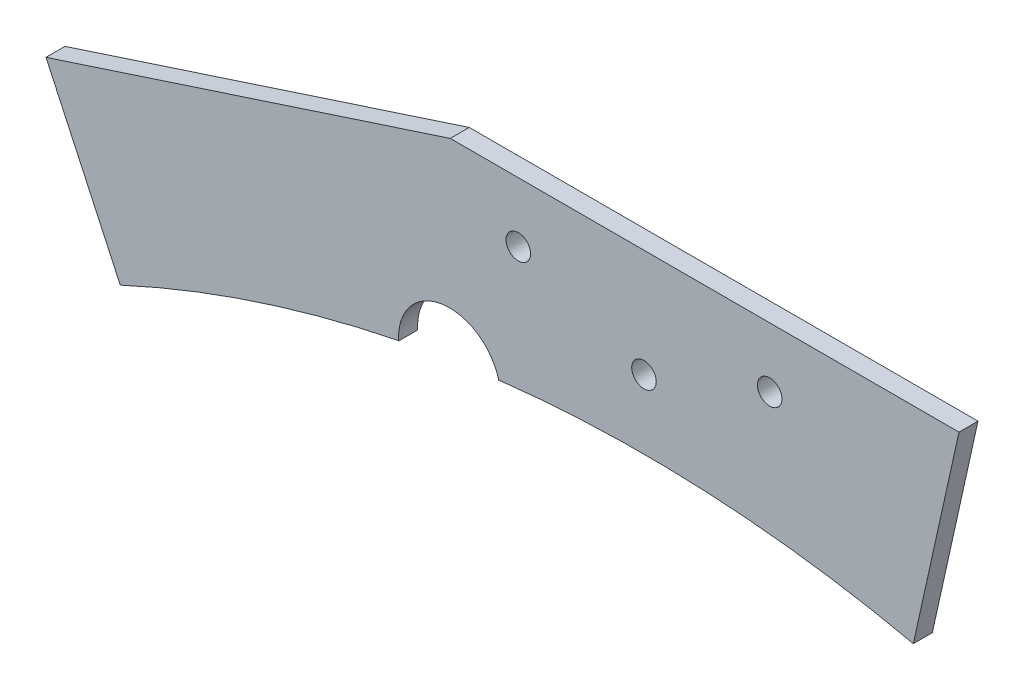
from build123d import *
from build123d.topology import SkipClean

# Parameters (mm, degrees)
BOSS_EXTRUDE1_DEPTH     = 6.35
SKETCH6_R               = 4.1
CUT_EXTRUDE1_DEPTH      = 524.620469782
SKETCH8_R               = 4.1
CUT_EXTRUDE2_DEPTH      = 524.620469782
CUT_EXTRUDE3_DEPTH      = 524.620469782
CUT_EXTRUDE3_DEPTH_BACK = 524.620469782
CUT_EXTRUDE8_DEPTH      = 516.357390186
BOSS_EXTRUDE3_START     = 6.35
BOSS_EXTRUDE3_DEPTH     = 6.35


with BuildPart() as part:
    # Sketch4 → Boss-Extrude1 (new body)
    with BuildSketch(Plane.XY):
        with BuildLine():
            Line((90, 406.147756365), (105.257260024, 475))
            Line((105.257260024, 475), (-220.256836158, 475))
            Line((-220.256836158, 475), (-175, 377.400317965))
            ThreePointArc((-175, 377.400317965), (-44.86483928, 413.573628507), (90, 406.147756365))
        make_face()
    extrude(amount=BOSS_EXTRUDE1_DEPTH)

    # Sketch6 → Cut-Extrude1 (cut, through all)
    with BuildSketch(Plane.XY.offset(6.35)):
        with Locations((0, 439)):
            Circle(SKETCH6_R)
    extrude(amount=-CUT_EXTRUDE1_DEPTH, mode=Mode.SUBTRACT)

    # Sketch8 → Cut-Extrude2 (cut, through all)
    with BuildSketch(Plane.XY.offset(6.35)):
        with Locations((42, 455)):
            Circle(SKETCH8_R)
        with Locations((-42, 455)):
            Circle(SKETCH8_R)
    extrude(amount=-CUT_EXTRUDE2_DEPTH, mode=Mode.SUBTRACT)

    # Sketch11 → Cut-Extrude3 (cut, two sides: drawn at the far end of the back side and taken through both)
    with BuildSketch(Plane.XY.offset(6.35).offset(-CUT_EXTRUDE3_DEPTH_BACK)):
        Polygon((-798.243534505, 235.666617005), (-199.819711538, 430.92584383), (-64.742739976, 475), (533.681082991, 670.259226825), (143.162629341, 1867.106872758), (-1188.761988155, 1432.514262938), align=None)
    extrude(amount=CUT_EXTRUDE3_DEPTH + CUT_EXTRUDE3_DEPTH_BACK, mode=Mode.SUBTRACT)

    # Sketch12 → Cut-Extrude8 (cut, through all)
    with BuildSketch(Plane.XY.offset(6.35)):
        with BuildLine():
            ThreePointArc((-48.550631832, 413.15715672), (-67.669082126, 425.654666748), (-81.969304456, 407.844373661))
            ThreePointArc((-81.969304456, 407.844373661), (-65.314009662, 410.840699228), (-48.550631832, 413.15715672))
        make_face()
    extrude(amount=-CUT_EXTRUDE8_DEPTH, mode=Mode.SUBTRACT)

    # Sketch13 → Boss-Extrude3 (add)
    with SkipClean():  # the faces are left unmerged after this step: merging them gives an invalid solid
        with BuildSketch(Plane.XY.offset(BOSS_EXTRUDE3_START)):
            with BuildLine():
                Line((-81.96468453, 407.770296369), (-82.045620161, 407.829028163))
                ThreePointArc((-82.045620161, 407.829028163), (-82.007462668, 407.836702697), (-81.969304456, 407.844373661))
                ThreePointArc((-81.969304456, 407.844373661), (-81.967034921, 407.807332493), (-81.96468453, 407.770296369))
            make_face()
            with BuildLine():
                Line((-48.532051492, 413.085298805), (-48.473319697, 413.166234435))
                ThreePointArc((-48.473319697, 413.166234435), (-48.511975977, 413.161697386), (-48.550631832, 413.15715672))
                ThreePointArc((-48.550631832, 413.15715672), (-48.541302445, 413.121237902), (-48.532051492, 413.085298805))
            make_face()
        extrude(amount=-BOSS_EXTRUDE3_DEPTH)


solid = part.part
